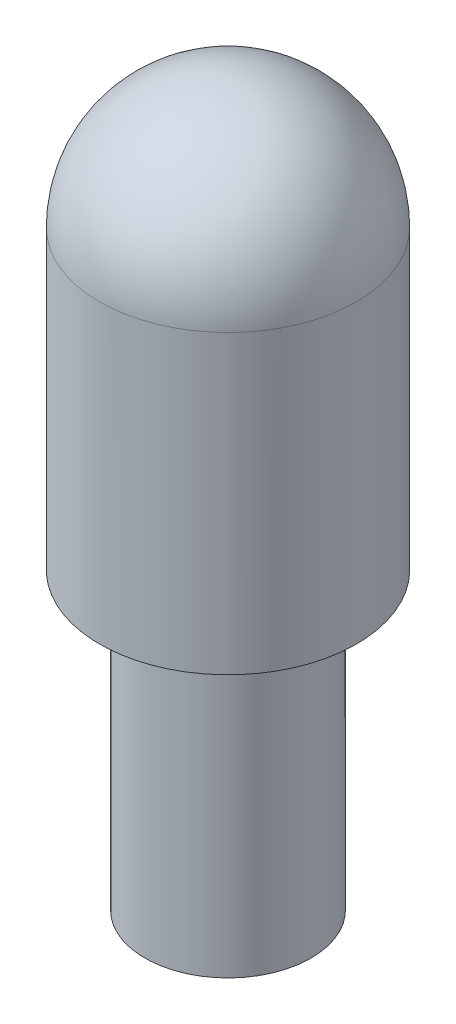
ISO-10303-21;
HEADER;
FILE_DESCRIPTION(('STEP AP214'),'2;1');
FILE_NAME('part.step','',(''),(''),'','','');
FILE_SCHEMA(('AUTOMOTIVE_DESIGN { 1 0 10303 214 1 1 1 1 }'));
ENDSEC;
DATA;
#1=APPLICATION_CONTEXT('core data for automotive mechanical design processes');
#2=APPLICATION_PROTOCOL_DEFINITION('international standard','automotive_design',2000,#1);
#3=PRODUCT_CONTEXT('',#1,'mechanical');
#4=PRODUCT('Part','Part','',(#3));
#5=PRODUCT_RELATED_PRODUCT_CATEGORY('part','',(#4));
#6=PRODUCT_DEFINITION_FORMATION('','',#4);
#7=PRODUCT_DEFINITION_CONTEXT('part definition',#1,'design');
#8=PRODUCT_DEFINITION('design','',#6,#7);
#9=PRODUCT_DEFINITION_SHAPE('','',#8);
#10=(LENGTH_UNIT() NAMED_UNIT(*) SI_UNIT(.MILLI.,.METRE.));
#11=(NAMED_UNIT(*) PLANE_ANGLE_UNIT() SI_UNIT($,.RADIAN.));
#12=(NAMED_UNIT(*) SI_UNIT($,.STERADIAN.) SOLID_ANGLE_UNIT());
#13=UNCERTAINTY_MEASURE_WITH_UNIT(LENGTH_MEASURE(1.E-05),#10,'distance_accuracy_value','');
#14=(GEOMETRIC_REPRESENTATION_CONTEXT(3) GLOBAL_UNCERTAINTY_ASSIGNED_CONTEXT((#13)) GLOBAL_UNIT_ASSIGNED_CONTEXT((#10,
#11,#12)) REPRESENTATION_CONTEXT('',''));
#15=CARTESIAN_POINT('',(0.,0.,0.));
#16=DIRECTION('',(0.,0.,1.));
#17=DIRECTION('',(1.,0.,0.));
#18=AXIS2_PLACEMENT_3D('',#15,#16,#17);
#19=CARTESIAN_POINT('',(0.,0.,0.));
#20=DIRECTION('',(0.,-1.,0.));
#21=DIRECTION('',(0.,0.,-1.));
#22=AXIS2_PLACEMENT_3D('',#19,#20,#21);
#23=PLANE('',#22);
#24=CARTESIAN_POINT('',(0.,0.,0.));
#25=DIRECTION('',(0.,-1.,0.));
#26=DIRECTION('',(0.,0.,-1.));
#27=AXIS2_PLACEMENT_3D('',#24,#25,#26);
#28=CIRCLE('',#27,1.2319);
#29=CARTESIAN_POINT('',(0.,0.,-1.2319));
#30=VERTEX_POINT('',#29);
#31=EDGE_CURVE('E43',#30,#30,#28,.T.);
#32=ORIENTED_EDGE('',*,*,#31,.T.);
#33=EDGE_LOOP('',(#32));
#34=FACE_BOUND('',#33,.T.);
#35=ADVANCED_FACE('F32',(#34),#23,.T.);
#36=CARTESIAN_POINT('',(0.,0.,0.));
#37=DIRECTION('',(0.,-1.,0.));
#38=DIRECTION('',(0.,0.,-1.));
#39=AXIS2_PLACEMENT_3D('',#36,#37,#38);
#40=CYLINDRICAL_SURFACE('',#39,1.2319);
#41=CARTESIAN_POINT('',(0.,4.1148,0.));
#42=DIRECTION('',(0.,-1.,0.));
#43=DIRECTION('',(0.,0.,-1.));
#44=AXIS2_PLACEMENT_3D('',#41,#42,#43);
#45=CIRCLE('',#44,1.2319);
#46=CARTESIAN_POINT('',(0.,4.1148,-1.2319));
#47=VERTEX_POINT('',#46);
#48=EDGE_CURVE('E39',#47,#47,#45,.T.);
#49=ORIENTED_EDGE('',*,*,#48,.T.);
#50=EDGE_LOOP('',(#49));
#51=FACE_BOUND('',#50,.T.);
#52=ORIENTED_EDGE('',*,*,#31,.F.);
#53=EDGE_LOOP('',(#52));
#54=FACE_BOUND('',#53,.T.);
#55=ADVANCED_FACE('F70',(#51,#54),#40,.T.);
#56=CARTESIAN_POINT('',(1.2319,4.3688,0.));
#57=DIRECTION('',(0.,-1.,0.));
#58=DIRECTION('',(0.,0.,-1.));
#59=AXIS2_PLACEMENT_3D('',#56,#57,#58);
#60=PLANE('',#59);
#61=CARTESIAN_POINT('',(0.,4.3688,0.));
#62=DIRECTION('',(0.,-1.,0.));
#63=DIRECTION('',(0.,0.,-1.));
#64=AXIS2_PLACEMENT_3D('',#61,#62,#63);
#65=CIRCLE('',#64,1.4859);
#66=CARTESIAN_POINT('',(0.,4.3688,-1.4859));
#67=VERTEX_POINT('',#66);
#68=EDGE_CURVE('E10',#67,#67,#65,.F.);
#69=ORIENTED_EDGE('',*,*,#68,.T.);
#70=EDGE_LOOP('',(#69));
#71=FACE_BOUND('',#70,.T.);
#72=CARTESIAN_POINT('',(0.,4.3688,0.));
#73=DIRECTION('',(0.,-1.,0.));
#74=DIRECTION('',(0.,0.,-1.));
#75=AXIS2_PLACEMENT_3D('',#72,#73,#74);
#76=CIRCLE('',#75,1.905);
#77=CARTESIAN_POINT('',(0.,4.3688,-1.905));
#78=VERTEX_POINT('',#77);
#79=EDGE_CURVE('E47',#78,#78,#76,.T.);
#80=ORIENTED_EDGE('',*,*,#79,.T.);
#81=EDGE_LOOP('',(#80));
#82=FACE_BOUND('',#81,.T.);
#83=ADVANCED_FACE('F67',(#71,#82),#60,.T.);
#84=CARTESIAN_POINT('',(0.,0.,0.));
#85=DIRECTION('',(0.,-1.,0.));
#86=DIRECTION('',(0.,0.,-1.));
#87=AXIS2_PLACEMENT_3D('',#84,#85,#86);
#88=CYLINDRICAL_SURFACE('',#87,1.905);
#89=CARTESIAN_POINT('',(0.,8.763,0.));
#90=DIRECTION('',(0.,-1.,0.));
#91=DIRECTION('',(0.,0.,-1.));
#92=AXIS2_PLACEMENT_3D('',#89,#90,#91);
#93=CIRCLE('',#92,1.905);
#94=CARTESIAN_POINT('',(0.,8.763,-1.905));
#95=VERTEX_POINT('',#94);
#96=EDGE_CURVE('E52',#95,#95,#93,.T.);
#97=ORIENTED_EDGE('',*,*,#96,.T.);
#98=EDGE_LOOP('',(#97));
#99=FACE_BOUND('',#98,.T.);
#100=ORIENTED_EDGE('',*,*,#79,.F.);
#101=EDGE_LOOP('',(#100));
#102=FACE_BOUND('',#101,.T.);
#103=ADVANCED_FACE('F56',(#99,#102),#88,.T.);
#104=CARTESIAN_POINT('',(0.,8.763,0.));
#105=DIRECTION('',(0.,-1.,0.));
#106=DIRECTION('',(1.,0.,0.));
#107=AXIS2_PLACEMENT_3D('',#104,#105,#106);
#108=SPHERICAL_SURFACE('',#107,1.905);
#109=ORIENTED_EDGE('',*,*,#96,.F.);
#110=EDGE_LOOP('',(#109));
#111=FACE_BOUND('',#110,.T.);
#112=ADVANCED_FACE('F59',(#111),#108,.T.);
#113=CARTESIAN_POINT('',(0.,4.1148,0.));
#114=DIRECTION('',(0.,-1.,0.));
#115=DIRECTION('',(0.,0.,-1.));
#116=AXIS2_PLACEMENT_3D('',#113,#114,#115);
#117=TOROIDAL_SURFACE('',#116,1.4859,0.254);
#118=ORIENTED_EDGE('',*,*,#68,.F.);
#119=EDGE_LOOP('',(#118));
#120=FACE_BOUND('',#119,.T.);
#121=ORIENTED_EDGE('',*,*,#48,.F.);
#122=EDGE_LOOP('',(#121));
#123=FACE_BOUND('',#122,.T.);
#124=ADVANCED_FACE('F34',(#120,#123),#117,.F.);
#125=CLOSED_SHELL('',(#35,#55,#83,#103,#112,#124));
#126=MANIFOLD_SOLID_BREP('B2',#125);
#127=ADVANCED_BREP_SHAPE_REPRESENTATION('',(#18,#126),#14);
#128=SHAPE_DEFINITION_REPRESENTATION(#9,#127);
ENDSEC;
END-ISO-10303-21;
